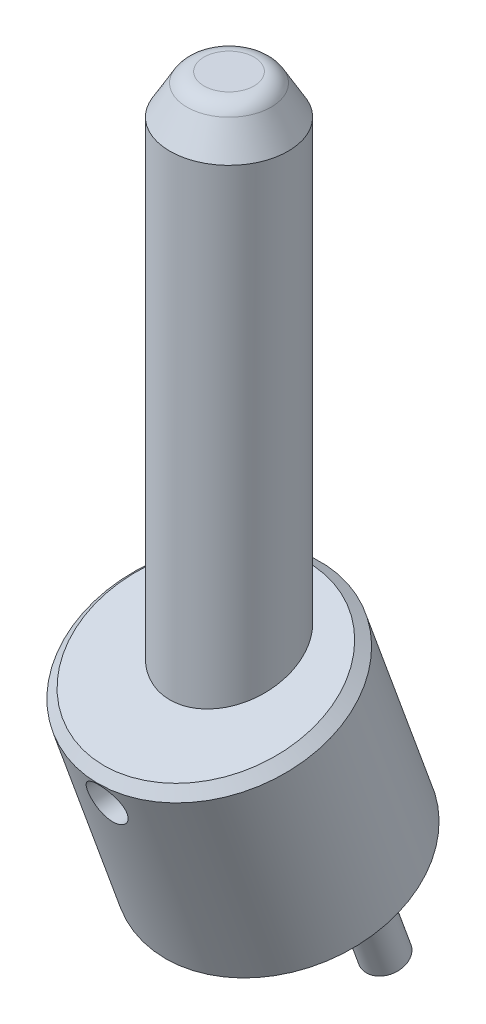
ISO-10303-21;
HEADER;
FILE_DESCRIPTION(('STEP AP214'),'2;1');
FILE_NAME('part.step','',(''),(''),'','','');
FILE_SCHEMA(('AUTOMOTIVE_DESIGN { 1 0 10303 214 1 1 1 1 }'));
ENDSEC;
DATA;
#1=APPLICATION_CONTEXT('core data for automotive mechanical design processes');
#2=APPLICATION_PROTOCOL_DEFINITION('international standard','automotive_design',2000,#1);
#3=PRODUCT_CONTEXT('',#1,'mechanical');
#4=PRODUCT('Part','Part','',(#3));
#5=PRODUCT_RELATED_PRODUCT_CATEGORY('part','',(#4));
#6=PRODUCT_DEFINITION_FORMATION('','',#4);
#7=PRODUCT_DEFINITION_CONTEXT('part definition',#1,'design');
#8=PRODUCT_DEFINITION('design','',#6,#7);
#9=PRODUCT_DEFINITION_SHAPE('','',#8);
#10=(LENGTH_UNIT() NAMED_UNIT(*) SI_UNIT(.MILLI.,.METRE.));
#11=(NAMED_UNIT(*) PLANE_ANGLE_UNIT() SI_UNIT($,.RADIAN.));
#12=(NAMED_UNIT(*) SI_UNIT($,.STERADIAN.) SOLID_ANGLE_UNIT());
#13=UNCERTAINTY_MEASURE_WITH_UNIT(LENGTH_MEASURE(1.E-05),#10,'distance_accuracy_value','');
#14=(GEOMETRIC_REPRESENTATION_CONTEXT(3) GLOBAL_UNCERTAINTY_ASSIGNED_CONTEXT((#13)) GLOBAL_UNIT_ASSIGNED_CONTEXT((#10,
#11,#12)) REPRESENTATION_CONTEXT('',''));
#15=CARTESIAN_POINT('',(0.,0.,0.));
#16=DIRECTION('',(0.,0.,1.));
#17=DIRECTION('',(1.,0.,0.));
#18=AXIS2_PLACEMENT_3D('',#15,#16,#17);
#19=CARTESIAN_POINT('',(0.,68.,0.));
#20=DIRECTION('',(0.,1.,0.));
#21=DIRECTION('',(-1.,0.,0.));
#22=AXIS2_PLACEMENT_3D('',#19,#20,#21);
#23=PLANE('',#22);
#24=CARTESIAN_POINT('',(0.,68.,-2.535898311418));
#25=CARTESIAN_POINT('',(0.036883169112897,68.,-2.53589886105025));
#26=CARTESIAN_POINT('',(0.073766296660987,68.,-2.53509366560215));
#27=CARTESIAN_POINT('',(0.147462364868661,68.,-2.53187573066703));
#28=CARTESIAN_POINT('',(0.184275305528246,68.,-2.52946299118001));
#29=CARTESIAN_POINT('',(0.257760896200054,68.,-2.52303391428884));
#30=CARTESIAN_POINT('',(0.294433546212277,68.,-2.51901757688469));
#31=CARTESIAN_POINT('',(0.367568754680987,68.,-2.50938912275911));
#32=CARTESIAN_POINT('',(0.404031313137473,68.,-2.50377700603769));
#33=CARTESIAN_POINT('',(0.476676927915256,68.,-2.49096762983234));
#34=CARTESIAN_POINT('',(0.512859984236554,68.,-2.48377037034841));
#35=CARTESIAN_POINT('',(0.584877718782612,68.,-2.46780442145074));
#36=CARTESIAN_POINT('',(0.620712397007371,68.,-2.459035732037));
#37=CARTESIAN_POINT('',(0.6919651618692,68.,-2.43994361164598));
#38=CARTESIAN_POINT('',(0.72738324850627,68.,-2.42962018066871));
#39=CARTESIAN_POINT('',(0.79773540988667,68.,-2.4074382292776));
#40=CARTESIAN_POINT('',(0.83266948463,68.,-2.39557970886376));
#41=CARTESIAN_POINT('',(0.901987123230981,68.,-2.37035015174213));
#42=CARTESIAN_POINT('',(0.936370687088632,68.,-2.35697911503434));
#43=CARTESIAN_POINT('',(1.00452185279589,68.,-2.32874997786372));
#44=CARTESIAN_POINT('',(1.0382894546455,68.,-2.31389187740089));
#45=CARTESIAN_POINT('',(1.10514441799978,68.,-2.28271689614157));
#46=CARTESIAN_POINT('',(1.13823177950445,68.,-2.26640001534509));
#47=CARTESIAN_POINT('',(1.20366327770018,68.,-2.23233853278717));
#48=CARTESIAN_POINT('',(1.23600741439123,68.,-2.21459393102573));
#49=CARTESIAN_POINT('',(1.29989089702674,68.,-2.17771078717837));
#50=CARTESIAN_POINT('',(1.3314302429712,68.,-2.15857224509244));
#51=CARTESIAN_POINT('',(1.3936440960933,68.,-2.11893764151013));
#52=CARTESIAN_POINT('',(1.42431860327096,67.9999999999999,-2.09844158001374));
#53=CARTESIAN_POINT('',(1.48474442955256,68.0000000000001,-2.05613099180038));
#54=CARTESIAN_POINT('',(1.51449574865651,68.0000000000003,-2.03431646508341));
#55=CARTESIAN_POINT('',(1.57301841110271,67.9999999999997,-1.98941032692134));
#56=CARTESIAN_POINT('',(1.60178975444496,67.9999999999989,-1.96631871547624));
#57=CARTESIAN_POINT('',(1.65829827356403,68.0000000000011,-1.91890290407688));
#58=CARTESIAN_POINT('',(1.68603544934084,68.0000000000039,-1.89457870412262));
#59=CARTESIAN_POINT('',(1.74042068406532,67.9999999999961,-1.8447420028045));
#60=CARTESIAN_POINT('',(1.76706874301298,67.9999999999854,-1.81922950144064));
#61=CARTESIAN_POINT('',(1.8202925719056,68.0000000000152,-1.76601289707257));
#62=CARTESIAN_POINT('',(1.84682143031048,68.0000000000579,-1.73826186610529));
#63=CARTESIAN_POINT('',(1.89860822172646,67.9999999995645,-1.68159729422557));
#64=CARTESIAN_POINT('',(1.9238661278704,67.9999999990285,-1.65268372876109));
#65=CARTESIAN_POINT('',(1.97305871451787,67.9999999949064,-1.59375026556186));
#66=CARTESIAN_POINT('',(1.99699333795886,67.9999999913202,-1.56373032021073));
#67=CARTESIAN_POINT('',(2.04349107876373,67.9999999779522,-1.50264174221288));
#68=CARTESIAN_POINT('',(2.06605410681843,67.9999999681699,-1.47157304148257));
#69=CARTESIAN_POINT('',(2.09883858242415,67.9999999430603,-1.42423763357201));
#70=CARTESIAN_POINT('',(2.10959070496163,67.9999999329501,-1.40833608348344));
#71=CARTESIAN_POINT('',(2.13071681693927,67.999999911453,-1.37630626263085));
#72=CARTESIAN_POINT('',(2.14109117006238,67.9999999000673,-1.36017823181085));
#73=CARTESIAN_POINT('',(2.17164317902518,67.9999998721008,-1.3114348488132));
#74=CARTESIAN_POINT('',(2.19125046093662,67.9999998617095,-1.27845923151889));
#75=CARTESIAN_POINT('',(2.22889472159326,67.9999998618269,-1.21162643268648));
#76=CARTESIAN_POINT('',(2.24693170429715,67.9999998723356,-1.17776925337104));
#77=CARTESIAN_POINT('',(2.28142653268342,67.9999999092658,-1.1092602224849));
#78=CARTESIAN_POINT('',(2.2978844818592,67.9999999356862,-1.07460842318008));
#79=CARTESIAN_POINT('',(2.32906360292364,67.9999999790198,-1.00453892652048));
#80=CARTESIAN_POINT('',(2.34378499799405,67.9999999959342,-0.969121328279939));
#81=CARTESIAN_POINT('',(2.36475646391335,68.0000000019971,-0.915929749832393));
#82=CARTESIAN_POINT('',(2.37150563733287,68.0000000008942,-0.89834771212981));
#83=CARTESIAN_POINT('',(2.3993801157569,67.9999999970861,-0.823272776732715));
#84=CARTESIAN_POINT('',(2.41865195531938,67.9999999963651,-0.765068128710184));
#85=CARTESIAN_POINT('',(2.44418154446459,67.9999999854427,-0.677429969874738));
#86=CARTESIAN_POINT('',(2.45206541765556,67.9999999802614,-0.648455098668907));
#87=CARTESIAN_POINT('',(2.46787714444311,67.9999999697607,-0.585935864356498));
#88=CARTESIAN_POINT('',(2.4756393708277,67.9999999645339,-0.552348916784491));
#89=CARTESIAN_POINT('',(2.48574292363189,67.999999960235,-0.504089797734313));
#90=CARTESIAN_POINT('',(2.4886547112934,67.999999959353,-0.489534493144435));
#91=CARTESIAN_POINT('',(2.49475257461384,67.9999999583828,-0.457572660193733));
#92=CARTESIAN_POINT('',(2.49788385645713,67.9999999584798,-0.440155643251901));
#93=CARTESIAN_POINT('',(2.50672485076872,67.9999999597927,-0.387811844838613));
#94=CARTESIAN_POINT('',(2.51188216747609,67.9999999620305,-0.352790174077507));
#95=CARTESIAN_POINT('',(2.52071043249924,67.9999999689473,-0.282561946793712));
#96=CARTESIAN_POINT('',(2.52438141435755,67.9999999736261,-0.247355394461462));
#97=CARTESIAN_POINT('',(2.53023391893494,67.9999999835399,-0.176819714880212));
#98=CARTESIAN_POINT('',(2.53241550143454,67.9999999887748,-0.141490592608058));
#99=CARTESIAN_POINT('',(2.53527542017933,67.9999999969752,-0.0707738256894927));
#100=CARTESIAN_POINT('',(2.53595384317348,67.9999999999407,-0.0353861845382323));
#101=CARTESIAN_POINT('',(2.53584272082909,68.0000000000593,0.0354236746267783));
#102=CARTESIAN_POINT('',(2.53505161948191,67.9999999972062,0.07084588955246));
#103=CARTESIAN_POINT('',(2.53203406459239,67.9999999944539,0.141627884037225));
#104=CARTESIAN_POINT('',(2.52980765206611,67.9999999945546,0.176987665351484));
#105=CARTESIAN_POINT('',(2.52391931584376,67.9999999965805,0.247588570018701));
#106=CARTESIAN_POINT('',(2.52025736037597,67.9999999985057,0.282829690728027));
#107=CARTESIAN_POINT('',(2.51148467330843,68.0000000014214,0.353133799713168));
#108=CARTESIAN_POINT('',(2.50637383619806,68.0000000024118,0.388196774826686));
#109=CARTESIAN_POINT('',(2.49768726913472,67.9999999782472,0.440622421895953));
#110=CARTESIAN_POINT('',(2.49462144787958,67.9999999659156,0.458070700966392));
#111=CARTESIAN_POINT('',(2.48998638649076,67.9999999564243,0.48262212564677));
#112=CARTESIAN_POINT('',(2.48860040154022,67.9999999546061,0.489759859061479));
#113=CARTESIAN_POINT('',(2.48087790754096,67.999999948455,0.528551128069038));
#114=CARTESIAN_POINT('',(2.47391141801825,67.9999999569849,0.560081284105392));
#115=CARTESIAN_POINT('',(2.45703812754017,67.9999999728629,0.630094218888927));
#116=CARTESIAN_POINT('',(2.44682379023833,67.9999999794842,0.66850231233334));
#117=CARTESIAN_POINT('',(2.42009300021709,67.9999999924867,0.760237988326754));
#118=CARTESIAN_POINT('',(2.40269884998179,67.9999999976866,0.813314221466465));
#119=CARTESIAN_POINT('',(2.37532992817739,67.9999999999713,0.888439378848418));
#120=CARTESIAN_POINT('',(2.36674512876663,67.9999999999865,0.911006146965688));
#121=CARTESIAN_POINT('',(2.34370620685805,68.0000000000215,0.969129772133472));
#122=CARTESIAN_POINT('',(2.32877605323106,68.000000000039,1.00450008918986));
#123=CARTESIAN_POINT('',(2.29733863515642,67.9999999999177,1.07453194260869));
#124=CARTESIAN_POINT('',(2.28083134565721,67.9999999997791,1.10919346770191));
#125=CARTESIAN_POINT('',(2.24628151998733,67.9999999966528,1.17774452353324));
#126=CARTESIAN_POINT('',(2.22823891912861,67.9999999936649,1.21163402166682));
#127=CARTESIAN_POINT('',(2.19064876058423,67.9999999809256,1.27857233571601));
#128=CARTESIAN_POINT('',(2.17110110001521,67.9999999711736,1.31162109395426));
#129=CARTESIAN_POINT('',(2.14068915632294,67.9999999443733,1.3605143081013));
#130=CARTESIAN_POINT('',(2.13036939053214,67.9999999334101,1.37669975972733));
#131=CARTESIAN_POINT('',(2.10937145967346,67.9999999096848,1.40881381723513));
#132=CARTESIAN_POINT('',(2.09869365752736,67.9999998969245,1.4247426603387));
#133=CARTESIAN_POINT('',(2.06610221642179,67.9999998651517,1.47214715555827));
#134=CARTESIAN_POINT('',(2.04363000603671,67.999999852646,1.50324163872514));
#135=CARTESIAN_POINT('',(1.99724969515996,67.9999998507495,1.56433742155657));
#136=CARTESIAN_POINT('',(1.97334159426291,67.9999998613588,1.59433872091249));
#137=CARTESIAN_POINT('',(1.92416677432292,67.9999999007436,1.65320597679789));
#138=CARTESIAN_POINT('',(1.89890014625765,67.999999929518,1.68207200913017));
#139=CARTESIAN_POINT('',(1.84696904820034,67.999999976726,1.73850866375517));
#140=CARTESIAN_POINT('',(1.82030476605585,67.999999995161,1.76607945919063));
#141=CARTESIAN_POINT('',(1.77844405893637,68.0000000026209,1.80781307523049));
#142=CARTESIAN_POINT('',(1.76359360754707,68.0000000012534,1.82232877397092));
#143=CARTESIAN_POINT('',(1.70076532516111,67.9999999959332,1.8822704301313));
#144=CARTESIAN_POINT('',(1.65118457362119,67.9999999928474,1.92605591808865));
#145=CARTESIAN_POINT('',(1.5748830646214,67.9999999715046,1.9882957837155));
#146=CARTESIAN_POINT('',(1.54939187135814,67.9999999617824,2.00828585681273));
#147=CARTESIAN_POINT('',(1.49369879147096,67.9999999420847,2.050241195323));
#148=CARTESIAN_POINT('',(1.46337192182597,67.9999999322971,2.07204201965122));
#149=CARTESIAN_POINT('',(1.41924057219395,67.9999999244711,2.10228130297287));
#150=CARTESIAN_POINT('',(1.40582016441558,67.9999999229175,2.11128590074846));
#151=CARTESIAN_POINT('',(1.37628726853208,67.9999999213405,2.13068692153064));
#152=CARTESIAN_POINT('',(1.36013950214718,67.9999999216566,2.14102971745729));
#153=CARTESIAN_POINT('',(1.31134786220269,67.9999999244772,2.17149865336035));
#154=CARTESIAN_POINT('',(1.27835328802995,67.9999999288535,2.19106696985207));
#155=CARTESIAN_POINT('',(1.21150292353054,67.9999999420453,2.22866698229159));
#156=CARTESIAN_POINT('',(1.17764716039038,67.9999999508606,2.2466987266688));
#157=CARTESIAN_POINT('',(1.10914688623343,67.9999999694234,2.28119223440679));
#158=CARTESIAN_POINT('',(1.07450241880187,67.9999999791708,2.29765408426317));
#159=CARTESIAN_POINT('',(1.00449363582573,67.9999999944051,2.32896042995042));
#160=CARTESIAN_POINT('',(0.969129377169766,67.9999999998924,2.34380505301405));
#161=CARTESIAN_POINT('',(0.900489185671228,68.0000000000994,2.37082264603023));
#162=CARTESIAN_POINT('',(0.867259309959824,67.9999999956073,2.383112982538));
#163=CARTESIAN_POINT('',(0.800333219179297,67.9999999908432,2.40634607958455));
#164=CARTESIAN_POINT('',(0.766637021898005,67.9999999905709,2.4172888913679));
#165=CARTESIAN_POINT('',(0.698829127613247,67.9999999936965,2.43780461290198));
#166=CARTESIAN_POINT('',(0.664717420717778,67.9999999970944,2.44737748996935));
#167=CARTESIAN_POINT('',(0.596126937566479,68.0000000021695,2.46511837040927));
#168=CARTESIAN_POINT('',(0.561648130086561,68.0000000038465,2.47328625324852));
#169=CARTESIAN_POINT('',(0.515953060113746,67.9999999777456,2.48318601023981));
#170=CARTESIAN_POINT('',(0.504864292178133,67.999999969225,2.48551694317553));
#171=CARTESIAN_POINT('',(0.482616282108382,67.9999999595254,2.48998940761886));
#172=CARTESIAN_POINT('',(0.471456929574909,67.9999999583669,2.492130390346));
#173=CARTESIAN_POINT('',(0.423172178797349,67.9999999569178,2.50104304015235));
#174=CARTESIAN_POINT('',(0.385898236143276,67.999999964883,2.50702839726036));
#175=CARTESIAN_POINT('',(0.321772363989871,67.9999999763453,2.51585849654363));
#176=CARTESIAN_POINT('',(0.294975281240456,67.9999999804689,2.5191122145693));
#177=CARTESIAN_POINT('',(0.23919081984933,67.9999999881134,2.52498124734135));
#178=CARTESIAN_POINT('',(0.210196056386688,67.9999999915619,2.52752672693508));
#179=CARTESIAN_POINT('',(0.144283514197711,67.9999999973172,2.53217247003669));
#180=CARTESIAN_POINT('',(0.107343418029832,67.9999999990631,2.5339662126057));
#181=CARTESIAN_POINT('',(0.0598216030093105,67.9999999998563,2.535240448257));
#182=CARTESIAN_POINT('',(0.0492560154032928,67.9999999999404,2.53545812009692));
#183=CARTESIAN_POINT('',(0.0257940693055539,68.0000000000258,2.5358007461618));
#184=CARTESIAN_POINT('',(0.0128972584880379,68.0000000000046,2.53589469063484));
#185=CARTESIAN_POINT('',(0.,68.,2.535898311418));
#186=B_SPLINE_CURVE_WITH_KNOTS('',3,(#24,#25,#26,#27,#28,#29,#30,#31,#32,#33,#34,#35,#36,#37,
#38,#39,#40,#41,#42,#43,#44,#45,#46,#47,#48,#49,#50,#51,#52,#53,#54,#55,#56,#57,#58,#59,#60,#61,
#62,#63,#64,#65,#66,#67,#68,#69,#70,#71,#72,#73,#74,#75,#76,#77,#78,#79,#80,#81,#82,#83,#84,#85,
#86,#87,#88,#89,#90,#91,#92,#93,#94,#95,#96,#97,#98,#99,#100,#101,#102,#103,#104,#105,#106,#107,
#108,#109,#110,#111,#112,#113,#114,#115,#116,#117,#118,#119,#120,#121,#122,#123,#124,#125,#126,
#127,#128,#129,#130,#131,#132,#133,#134,#135,#136,#137,#138,#139,#140,#141,#142,#143,#144,#145,
#146,#147,#148,#149,#150,#151,#152,#153,#154,#155,#156,#157,#158,#159,#160,#161,#162,#163,#164,
#165,#166,#167,#168,#169,#170,#171,#172,#173,#174,#175,#176,#177,#178,#179,#180,#181,#182,#183,
#184,#185),.UNSPECIFIED.,.F.,.F.,(4,2,2,2,2,2,2,2,2,2,2,2,2,2,2,2,2,2,2,2,2,2,2,2,2,2,2,2,2,2,2,
2,2,2,2,2,2,2,2,2,2,2,2,2,2,2,2,2,2,2,2,2,2,2,2,2,2,2,2,2,2,2,2,2,2,2,2,2,2,2,2,2,2,2,2,2,2,2,2,
2,4),(0.,0.110640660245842,0.221281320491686,0.331921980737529,0.442562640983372,
0.553203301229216,0.663843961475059,0.774484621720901,0.885125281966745,0.995765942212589,
1.10640660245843,1.21704726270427,1.32768792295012,1.43832858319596,1.5489692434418,
1.65960990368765,1.77025056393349,1.88089122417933,1.99153188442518,2.1066670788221,
2.22180470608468,2.33694729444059,2.4520973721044,2.50967964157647,2.56720492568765,
2.68225193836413,2.79729866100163,2.91233783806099,3.02736221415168,3.08386094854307,
3.26759502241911,3.35766742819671,3.46104881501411,3.50557819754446,3.5586633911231,
3.664827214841,3.77098864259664,3.87714580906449,3.98329684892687,4.08956035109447,
4.19582081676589,4.30208363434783,4.40835419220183,4.46149681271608,4.48330971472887,
4.58015248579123,4.69934379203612,4.86676229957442,4.93919017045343,5.05432498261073,
5.16946162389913,5.28460311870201,5.39975249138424,5.45733469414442,5.51486019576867,
5.62990814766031,5.7449561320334,5.8599964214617,5.97502128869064,6.03732000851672,
6.23550767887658,6.33267539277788,6.44467917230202,6.49316106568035,6.55068488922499,
6.66572394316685,6.78075936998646,6.89578845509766,7.01080848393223,7.11706931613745,
7.22332610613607,7.32958543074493,7.43585386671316,7.46984616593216,7.50393367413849,
7.61714192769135,7.69811153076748,7.78541399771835,7.89632395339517,7.92802697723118,
7.96671753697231),.UNSPECIFIED.);
#187=CARTESIAN_POINT('',(0.,68.,-2.5358983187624));
#188=VERTEX_POINT('',#187);
#189=CARTESIAN_POINT('',(0.,68.,2.5358983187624));
#190=VERTEX_POINT('',#189);
#191=EDGE_CURVE('P0_E38',#188,#190,#186,.T.);
#192=ORIENTED_EDGE('',*,*,#191,.F.);
#193=CARTESIAN_POINT('',(0.,68.,0.));
#194=DIRECTION('',(0.,-1.,0.));
#195=DIRECTION('',(0.,0.,1.));
#196=AXIS2_PLACEMENT_3D('',#193,#194,#195);
#197=CIRCLE('',#196,2.535898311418);
#198=EDGE_CURVE('P0_E42',#190,#188,#197,.T.);
#199=ORIENTED_EDGE('',*,*,#198,.F.);
#200=EDGE_LOOP('',(#192,#199));
#201=FACE_BOUND('',#200,.T.);
#202=ADVANCED_FACE('P0_F17',(#201),#23,.T.);
#203=CARTESIAN_POINT('',(0.,66.,0.));
#204=DIRECTION('',(0.,1.,0.));
#205=DIRECTION('',(0.0152566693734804,0.,0.999883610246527));
#206=AXIS2_PLACEMENT_3D('',#203,#204,#205);
#207=TOROIDAL_SURFACE('',#206,2.535898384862,2.);
#208=ORIENTED_EDGE('',*,*,#191,.T.);
#209=ORIENTED_EDGE('',*,*,#198,.T.);
#210=EDGE_LOOP('',(#208,#209));
#211=FACE_BOUND('',#210,.T.);
#212=CARTESIAN_POINT('',(0.,67.000000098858,0.));
#213=DIRECTION('',(0.,-1.,0.));
#214=DIRECTION('',(0.,0.,1.));
#215=AXIS2_PLACEMENT_3D('',#212,#213,#214);
#216=CIRCLE('',#215,4.26794913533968);
#217=CARTESIAN_POINT('',(0.,67.000000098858,4.26794913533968));
#218=VERTEX_POINT('',#217);
#219=EDGE_CURVE('P0_E48',#218,#218,#216,.T.);
#220=ORIENTED_EDGE('',*,*,#219,.F.);
#221=EDGE_LOOP('',(#220));
#222=FACE_BOUND('',#221,.T.);
#223=ADVANCED_FACE('P0_F40',(#211,#222),#207,.T.);
#224=CARTESIAN_POINT('',(0.,0.,0.));
#225=DIRECTION('',(0.,1.,0.));
#226=DIRECTION('',(-1.,0.,0.));
#227=AXIS2_PLACEMENT_3D('',#224,#225,#226);
#228=PLANE('',#227);
#229=CARTESIAN_POINT('',(0.,0.,0.));
#230=DIRECTION('',(0.,1.,0.));
#231=DIRECTION('',(-1.,0.,0.));
#232=AXIS2_PLACEMENT_3D('',#229,#230,#231);
#233=CIRCLE('',#232,5.00000122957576);
#234=CARTESIAN_POINT('',(-5.00000122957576,0.,0.));
#235=VERTEX_POINT('',#234);
#236=EDGE_CURVE('P0_E85',#235,#235,#233,.T.);
#237=ORIENTED_EDGE('',*,*,#236,.F.);
#238=EDGE_LOOP('',(#237));
#239=FACE_BOUND('',#238,.T.);
#240=ADVANCED_FACE('P0_F76',(#239),#228,.F.);
#241=CARTESIAN_POINT('',(0.,10.,2.15470053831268));
#242=DIRECTION('',(0.,0.,1.));
#243=DIRECTION('',(0.,-1.,0.));
#244=AXIS2_PLACEMENT_3D('',#241,#242,#243);
#245=CONICAL_SURFACE('',#244,2.00000000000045,1.0471975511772);
#246=CARTESIAN_POINT('',(0.,9.99999999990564,0.99999999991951));
#247=VERTEX_POINT('',#246);
#248=VERTEX_LOOP('',#247);
#249=FACE_BOUND('',#248,.T.);
#250=CARTESIAN_POINT('',(0.,10.,2.154700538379));
#251=DIRECTION('',(0.,0.,1.));
#252=DIRECTION('',(0.,-1.,0.));
#253=AXIS2_PLACEMENT_3D('',#250,#251,#252);
#254=CIRCLE('',#253,2.);
#255=CARTESIAN_POINT('',(0.,8.,2.154700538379));
#256=VERTEX_POINT('',#255);
#257=EDGE_CURVE('P0_E82',#256,#256,#254,.T.);
#258=ORIENTED_EDGE('',*,*,#257,.T.);
#259=EDGE_LOOP('',(#258));
#260=FACE_BOUND('',#259,.T.);
#261=ADVANCED_FACE('P0_F116',(#249,#260),#245,.F.);
#262=CARTESIAN_POINT('',(0.,63.9999999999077,0.));
#263=DIRECTION('',(0.,-1.,0.));
#264=DIRECTION('',(1.,0.,0.));
#265=AXIS2_PLACEMENT_3D('',#262,#263,#264);
#266=CONICAL_SURFACE('',#265,6.00000000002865,0.523598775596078);
#267=CARTESIAN_POINT('',(0.,64.,0.));
#268=DIRECTION('',(0.,1.,0.));
#269=DIRECTION('',(-1.,0.,0.));
#270=AXIS2_PLACEMENT_3D('',#267,#268,#269);
#271=CIRCLE('',#270,6.);
#272=CARTESIAN_POINT('',(-6.,64.,0.));
#273=VERTEX_POINT('',#272);
#274=EDGE_CURVE('P0_E92',#273,#273,#271,.F.);
#275=ORIENTED_EDGE('',*,*,#274,.F.);
#276=EDGE_LOOP('',(#275));
#277=FACE_BOUND('',#276,.T.);
#278=ORIENTED_EDGE('',*,*,#219,.T.);
#279=EDGE_LOOP('',(#278));
#280=FACE_BOUND('',#279,.T.);
#281=ADVANCED_FACE('P0_F108',(#277,#280),#266,.T.);
#282=CARTESIAN_POINT('',(0.,1.00000004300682,0.));
#283=DIRECTION('',(0.,1.,0.));
#284=DIRECTION('',(-1.,0.,0.));
#285=AXIS2_PLACEMENT_3D('',#282,#283,#284);
#286=CONICAL_SURFACE('',#285,6.0000015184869,0.785398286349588);
#287=CARTESIAN_POINT('',(0.,1.000001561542,0.));
#288=DIRECTION('',(0.,1.,0.));
#289=DIRECTION('',(-1.,0.,0.));
#290=AXIS2_PLACEMENT_3D('',#287,#288,#289);
#291=CIRCLE('',#290,6.);
#292=CARTESIAN_POINT('',(-6.,1.000001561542,0.));
#293=VERTEX_POINT('',#292);
#294=EDGE_CURVE('P0_E28',#293,#293,#291,.T.);
#295=ORIENTED_EDGE('',*,*,#294,.F.);
#296=EDGE_LOOP('',(#295));
#297=FACE_BOUND('',#296,.T.);
#298=ORIENTED_EDGE('',*,*,#236,.T.);
#299=EDGE_LOOP('',(#298));
#300=FACE_BOUND('',#299,.T.);
#301=ADVANCED_FACE('P0_F105',(#297,#300),#286,.T.);
#302=CARTESIAN_POINT('',(0.,10.,0.65));
#303=DIRECTION('',(0.,0.,1.));
#304=DIRECTION('',(0.,-1.,0.));
#305=AXIS2_PLACEMENT_3D('',#302,#303,#304);
#306=CYLINDRICAL_SURFACE('',#305,2.);
#307=ORIENTED_EDGE('',*,*,#257,.F.);
#308=EDGE_LOOP('',(#307));
#309=FACE_BOUND('',#308,.T.);
#310=CARTESIAN_POINT('',(0.,8.,6.));
#311=CARTESIAN_POINT('',(-0.108974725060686,8.00000612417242,5.99999564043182));
#312=CARTESIAN_POINT('',(-0.218061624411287,8.00894817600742,5.9969989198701));
#313=CARTESIAN_POINT('',(-0.433135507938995,8.04441497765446,5.98531898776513));
#314=CARTESIAN_POINT('',(-0.539117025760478,8.07096899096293,5.97662631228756));
#315=CARTESIAN_POINT('',(-0.744677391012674,8.14064454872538,5.9545040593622));
#316=CARTESIAN_POINT('',(-0.844270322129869,8.18372807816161,5.94108535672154));
#317=CARTESIAN_POINT('',(-1.03478027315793,8.2851008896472,5.91088362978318));
#318=CARTESIAN_POINT('',(-1.12569835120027,8.34338831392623,5.8941010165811));
#319=CARTESIAN_POINT('',(-1.29948066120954,8.475649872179,5.8582823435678));
#320=CARTESIAN_POINT('',(-1.3820029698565,8.55005856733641,5.83919212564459));
#321=CARTESIAN_POINT('',(-1.53366185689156,8.71152973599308,5.80120729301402));
#322=CARTESIAN_POINT('',(-1.60279478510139,8.79859564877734,5.78231273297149));
#323=CARTESIAN_POINT('',(-1.72765000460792,8.98597045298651,5.7462666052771));
#324=CARTESIAN_POINT('',(-1.78292996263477,9.08658794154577,5.72918070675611));
#325=CARTESIAN_POINT('',(-1.87563792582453,9.2963526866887,5.69950605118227));
#326=CARTESIAN_POINT('',(-1.91307145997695,9.40549728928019,5.68691590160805));
#327=CARTESIAN_POINT('',(-1.96774691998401,9.62534643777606,5.66822606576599));
#328=CARTESIAN_POINT('',(-1.98562689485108,9.73587440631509,5.66192191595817));
#329=CARTESIAN_POINT('',(-2.00268224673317,9.95852749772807,5.65591313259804));
#330=CARTESIAN_POINT('',(-2.00186340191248,10.0706521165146,5.65620646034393));
#331=CARTESIAN_POINT('',(-1.98203983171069,10.2878730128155,5.66318029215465));
#332=CARTESIAN_POINT('',(-1.96386791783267,10.393056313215,5.66956828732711));
#333=CARTESIAN_POINT('',(-1.9112124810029,10.5987863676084,5.68753310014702));
#334=CARTESIAN_POINT('',(-1.87672692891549,10.699332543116,5.69911056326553));
#335=CARTESIAN_POINT('',(-1.79187699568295,10.8948281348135,5.72635859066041));
#336=CARTESIAN_POINT('',(-1.74126547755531,10.9896611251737,5.74209216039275));
#337=CARTESIAN_POINT('',(-1.62577463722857,11.1697464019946,5.77585213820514));
#338=CARTESIAN_POINT('',(-1.56089195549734,11.2549964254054,5.79387908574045));
#339=CARTESIAN_POINT('',(-1.41471183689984,11.4181688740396,5.83134330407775));
#340=CARTESIAN_POINT('',(-1.33273573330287,11.4954788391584,5.85080514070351));
#341=CARTESIAN_POINT('',(-1.15670996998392,11.6354411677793,5.88813263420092));
#342=CARTESIAN_POINT('',(-1.06265504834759,11.6980871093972,5.90599758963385));
#343=CARTESIAN_POINT('',(-0.86381483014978,11.8074392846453,5.93835612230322));
#344=CARTESIAN_POINT('',(-0.75892625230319,11.8539693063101,5.95281190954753));
#345=CARTESIAN_POINT('',(-0.542326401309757,11.9284560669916,5.97642703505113));
#346=CARTESIAN_POINT('',(-0.430629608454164,11.9564508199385,5.98559720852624));
#347=CARTESIAN_POINT('',(-0.264915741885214,11.9830911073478,5.99438078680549));
#348=CARTESIAN_POINT('',(-0.212162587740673,11.9894240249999,5.99648164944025));
#349=CARTESIAN_POINT('',(-0.106281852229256,11.9978799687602,5.99929232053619));
#350=CARTESIAN_POINT('',(-0.0531542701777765,12.000002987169,6.00000212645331));
#351=CARTESIAN_POINT('',(0.108974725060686,11.9999938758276,5.99999564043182));
#352=CARTESIAN_POINT('',(0.218061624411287,11.9910518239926,5.9969989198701));
#353=CARTESIAN_POINT('',(0.433135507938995,11.9555850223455,5.98531898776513));
#354=CARTESIAN_POINT('',(0.539117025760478,11.9290310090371,5.97662631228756));
#355=CARTESIAN_POINT('',(0.744677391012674,11.8593554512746,5.9545040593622));
#356=CARTESIAN_POINT('',(0.844270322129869,11.8162719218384,5.94108535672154));
#357=CARTESIAN_POINT('',(1.03478027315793,11.7148991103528,5.91088362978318));
#358=CARTESIAN_POINT('',(1.12569835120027,11.6566116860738,5.8941010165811));
#359=CARTESIAN_POINT('',(1.29948066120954,11.524350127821,5.8582823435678));
#360=CARTESIAN_POINT('',(1.3820029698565,11.4499414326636,5.83919212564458));
#361=CARTESIAN_POINT('',(1.53366185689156,11.2884702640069,5.80120729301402));
#362=CARTESIAN_POINT('',(1.60279478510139,11.2014043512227,5.78231273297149));
#363=CARTESIAN_POINT('',(1.72765000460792,11.0140295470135,5.7462666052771));
#364=CARTESIAN_POINT('',(1.78292996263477,10.9134120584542,5.72918070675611));
#365=CARTESIAN_POINT('',(1.87563792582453,10.7036473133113,5.69950605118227));
#366=CARTESIAN_POINT('',(1.91307145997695,10.5945027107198,5.68691590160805));
#367=CARTESIAN_POINT('',(1.96774691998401,10.3746535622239,5.66822606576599));
#368=CARTESIAN_POINT('',(1.98562689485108,10.2641255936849,5.66192191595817));
#369=CARTESIAN_POINT('',(2.00268224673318,10.0414725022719,5.65591313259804));
#370=CARTESIAN_POINT('',(2.00186340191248,9.92934788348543,5.65620646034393));
#371=CARTESIAN_POINT('',(1.98203983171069,9.71212698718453,5.66318029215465));
#372=CARTESIAN_POINT('',(1.96386791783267,9.60694368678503,5.66956828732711));
#373=CARTESIAN_POINT('',(1.9112124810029,9.40121363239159,5.68753310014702));
#374=CARTESIAN_POINT('',(1.87672692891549,9.30066745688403,5.69911056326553));
#375=CARTESIAN_POINT('',(1.79187699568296,9.10517186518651,5.72635859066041));
#376=CARTESIAN_POINT('',(1.74126547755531,9.01033887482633,5.74209216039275));
#377=CARTESIAN_POINT('',(1.62577463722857,8.83025359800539,5.77585213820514));
#378=CARTESIAN_POINT('',(1.56089195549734,8.74500357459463,5.79387908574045));
#379=CARTESIAN_POINT('',(1.41471183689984,8.58183112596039,5.83134330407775));
#380=CARTESIAN_POINT('',(1.33273573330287,8.50452116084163,5.85080514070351));
#381=CARTESIAN_POINT('',(1.15670996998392,8.36455883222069,5.88813263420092));
#382=CARTESIAN_POINT('',(1.06265504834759,8.30191289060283,5.90599758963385));
#383=CARTESIAN_POINT('',(0.86381483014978,8.19256071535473,5.93835612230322));
#384=CARTESIAN_POINT('',(0.75892625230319,8.14603069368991,5.95281190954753));
#385=CARTESIAN_POINT('',(0.542326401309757,8.07154393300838,5.97642703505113));
#386=CARTESIAN_POINT('',(0.430629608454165,8.04354918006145,5.98559720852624));
#387=CARTESIAN_POINT('',(0.264915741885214,8.01690889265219,5.99438078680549));
#388=CARTESIAN_POINT('',(0.212162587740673,8.01057597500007,5.99648164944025));
#389=CARTESIAN_POINT('',(0.106281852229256,8.00212003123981,5.99929232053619));
#390=CARTESIAN_POINT('',(0.0531542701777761,7.99999701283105,6.00000212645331));
#391=CARTESIAN_POINT('',(0.,8.,6.));
#392=B_SPLINE_CURVE_WITH_KNOTS('',3,(#310,#311,#312,#313,#314,#315,#316,#317,#318,#319,#320,
#321,#322,#323,#324,#325,#326,#327,#328,#329,#330,#331,#332,#333,#334,#335,#336,#337,#338,#339,
#340,#341,#342,#343,#344,#345,#346,#347,#348,#349,#350,#351,#352,#353,#354,#355,#356,#357,#358,
#359,#360,#361,#362,#363,#364,#365,#366,#367,#368,#369,#370,#371,#372,#373,#374,#375,#376,#377,
#378,#379,#380,#381,#382,#383,#384,#385,#386,#387,#388,#389,#390,#391),.UNSPECIFIED.,.T.,.F.,(4,
2,2,2,2,2,2,2,2,2,2,2,2,2,2,2,2,2,2,2,2,2,2,2,2,2,2,2,2,2,2,2,2,2,2,2,2,2,2,2,4),(0.,
0.32671907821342,0.653982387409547,0.980497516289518,1.30697276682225,1.64368488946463,
1.98048867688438,2.32696849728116,2.67334090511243,3.00803851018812,3.34263269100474,
3.6619357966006,3.98127862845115,4.30577211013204,4.63034206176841,4.97180786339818,
5.31342292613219,5.65866330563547,6.00319342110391,6.16255590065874,6.32191867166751,
6.64863774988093,6.97590105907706,7.30241618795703,7.62889143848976,7.96560356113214,
8.30240734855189,8.64888716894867,8.99525957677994,9.32995718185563,9.66455136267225,
9.98385446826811,10.3031973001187,10.6276907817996,10.9522607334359,11.2937265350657,
11.6353415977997,11.980581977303,12.3251120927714,12.4844745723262,12.643837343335),.UNSPECIFIED.);
#393=CARTESIAN_POINT('',(0.,8.,6.));
#394=VERTEX_POINT('',#393);
#395=EDGE_CURVE('P0_E11',#394,#394,#392,.T.);
#396=ORIENTED_EDGE('',*,*,#395,.F.);
#397=EDGE_LOOP('',(#396));
#398=FACE_BOUND('',#397,.T.);
#399=ADVANCED_FACE('P0_F107',(#309,#398),#306,.F.);
#400=CARTESIAN_POINT('',(0.,-3.4,0.));
#401=DIRECTION('',(0.,1.,0.));
#402=DIRECTION('',(-1.,0.,0.));
#403=AXIS2_PLACEMENT_3D('',#400,#401,#402);
#404=CYLINDRICAL_SURFACE('',#403,6.);
#405=ORIENTED_EDGE('',*,*,#274,.T.);
#406=EDGE_LOOP('',(#405));
#407=FACE_BOUND('',#406,.T.);
#408=ORIENTED_EDGE('',*,*,#294,.T.);
#409=EDGE_LOOP('',(#408));
#410=FACE_BOUND('',#409,.T.);
#411=ORIENTED_EDGE('',*,*,#395,.T.);
#412=EDGE_LOOP('',(#411));
#413=FACE_BOUND('',#412,.T.);
#414=ADVANCED_FACE('P0_F102',(#407,#410,#413),#404,.T.);
#415=CLOSED_SHELL('',(#202,#223,#240,#261,#281,#301,#399,#414));
#416=MANIFOLD_SOLID_BREP('P0_B1',#415);
#417=CARTESIAN_POINT('',(0.,-9.16644374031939,-7.22733246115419));
#418=DIRECTION('',(0.,-0.939692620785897,-0.342020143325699));
#419=DIRECTION('',(0.,0.342020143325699,-0.939692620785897));
#420=AXIS2_PLACEMENT_3D('',#417,#418,#419);
#421=PLANE('',#420);
#422=CARTESIAN_POINT('',(-8.75,-9.16644374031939,-7.22733246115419));
#423=DIRECTION('',(0.,-0.939692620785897,-0.342020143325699));
#424=DIRECTION('',(0.,0.342020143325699,-0.939692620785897));
#425=AXIS2_PLACEMENT_3D('',#422,#423,#424);
#426=CIRCLE('',#425,1.49996275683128);
#427=CARTESIAN_POINT('',(-8.75,-8.65342626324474,-8.63683639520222));
#428=VERTEX_POINT('',#427);
#429=EDGE_CURVE('P1_E17',#428,#428,#426,.F.);
#430=ORIENTED_EDGE('',*,*,#429,.F.);
#431=EDGE_LOOP('',(#430));
#432=FACE_BOUND('',#431,.T.);
#433=ADVANCED_FACE('P1_F14',(#432),#421,.T.);
#434=CARTESIAN_POINT('',(0.,-9.16644374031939,-7.22733246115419));
#435=DIRECTION('',(0.,-0.939692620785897,-0.342020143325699));
#436=DIRECTION('',(0.,0.342020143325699,-0.939692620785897));
#437=AXIS2_PLACEMENT_3D('',#434,#435,#436);
#438=PLANE('',#437);
#439=CARTESIAN_POINT('',(8.75,-9.16644374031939,-7.22733246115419));
#440=DIRECTION('',(0.,-0.939692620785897,-0.342020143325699));
#441=DIRECTION('',(0.,0.342020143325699,-0.939692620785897));
#442=AXIS2_PLACEMENT_3D('',#439,#440,#441);
#443=CIRCLE('',#442,1.49996275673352);
#444=CARTESIAN_POINT('',(8.75,-8.65342626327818,-8.63683639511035));
#445=VERTEX_POINT('',#444);
#446=EDGE_CURVE('P1_E114',#445,#445,#443,.F.);
#447=ORIENTED_EDGE('',*,*,#446,.F.);
#448=EDGE_LOOP('',(#447));
#449=FACE_BOUND('',#448,.T.);
#450=ADVANCED_FACE('P1_F104',(#449),#438,.T.);
#451=CARTESIAN_POINT('',(0.,3.31765864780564E-13,1.40512601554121E-13));
#452=DIRECTION('',(0.,-1.,0.));
#453=DIRECTION('',(0.,0.,-1.));
#454=AXIS2_PLACEMENT_3D('',#451,#452,#453);
#455=PLANE('',#454);
#456=CARTESIAN_POINT('',(0.,3.71664504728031E-13,-1.17614251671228E-12));
#457=DIRECTION('',(0.,-1.,0.));
#458=DIRECTION('',(0.,0.,-1.));
#459=AXIS2_PLACEMENT_3D('',#456,#457,#458);
#460=CIRCLE('',#459,6.);
#461=CARTESIAN_POINT('',(0.,3.71664504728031E-13,-6.00000000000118));
#462=VERTEX_POINT('',#461);
#463=EDGE_CURVE('P1_E116',#462,#462,#460,.F.);
#464=ORIENTED_EDGE('',*,*,#463,.T.);
#465=EDGE_LOOP('',(#464));
#466=FACE_BOUND('',#465,.T.);
#467=ADVANCED_FACE('P1_F101',(#466),#455,.F.);
#468=CARTESIAN_POINT('',(-8.75,-8.69657085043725,-7.05631271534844));
#469=DIRECTION('',(0.,0.939692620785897,0.342020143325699));
#470=DIRECTION('',(0.,-0.342020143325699,0.939692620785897));
#471=AXIS2_PLACEMENT_3D('',#468,#469,#470);
#472=CONICAL_SURFACE('',#471,1.99997862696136,0.785385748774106);
#473=CARTESIAN_POINT('',(-8.75,-8.69655076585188,-7.0563054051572));
#474=DIRECTION('',(0.,0.939692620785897,0.342020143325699));
#475=DIRECTION('',(0.,-0.342020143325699,0.939692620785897));
#476=AXIS2_PLACEMENT_3D('',#473,#474,#475);
#477=CIRCLE('',#476,2.);
#478=CARTESIAN_POINT('',(-8.75,-9.38059105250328,-5.1769201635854));
#479=VERTEX_POINT('',#478);
#480=EDGE_CURVE('P1_E118',#479,#479,#477,.T.);
#481=ORIENTED_EDGE('',*,*,#480,.F.);
#482=EDGE_LOOP('',(#481));
#483=FACE_BOUND('',#482,.T.);
#484=ORIENTED_EDGE('',*,*,#429,.T.);
#485=EDGE_LOOP('',(#484));
#486=FACE_BOUND('',#485,.T.);
#487=ADVANCED_FACE('P1_F97',(#483,#486),#472,.T.);
#488=CARTESIAN_POINT('',(8.75,-8.696570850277,-7.05631271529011));
#489=DIRECTION('',(0.,0.939692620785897,0.342020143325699));
#490=DIRECTION('',(0.,-0.342020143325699,0.939692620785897));
#491=AXIS2_PLACEMENT_3D('',#488,#489,#490);
#492=CONICAL_SURFACE('',#491,1.99997862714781,0.785385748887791);
#493=CARTESIAN_POINT('',(8.75,-8.69655076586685,-7.05630540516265));
#494=DIRECTION('',(0.,0.939692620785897,0.342020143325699));
#495=DIRECTION('',(0.,-0.342020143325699,0.939692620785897));
#496=AXIS2_PLACEMENT_3D('',#493,#494,#495);
#497=CIRCLE('',#496,2.);
#498=CARTESIAN_POINT('',(8.75,-9.38059105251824,-5.17692016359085));
#499=VERTEX_POINT('',#498);
#500=EDGE_CURVE('P1_E123',#499,#499,#497,.T.);
#501=ORIENTED_EDGE('',*,*,#500,.F.);
#502=EDGE_LOOP('',(#501));
#503=FACE_BOUND('',#502,.T.);
#504=ORIENTED_EDGE('',*,*,#446,.T.);
#505=EDGE_LOOP('',(#504));
#506=FACE_BOUND('',#505,.T.);
#507=ADVANCED_FACE('P1_F92',(#503,#506),#492,.T.);
#508=CARTESIAN_POINT('',(0.,26.271199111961,-1.17787724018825E-12));
#509=DIRECTION('',(0.,-1.,0.));
#510=DIRECTION('',(0.,0.,-1.));
#511=AXIS2_PLACEMENT_3D('',#508,#509,#510);
#512=CYLINDRICAL_SURFACE('',#511,6.);
#513=CARTESIAN_POINT('',(0.,18.0000000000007,-1.17787724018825E-12));
#514=DIRECTION('',(0.,0.939692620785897,0.342020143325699));
#515=DIRECTION('',(0.,-0.342020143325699,0.939692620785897));
#516=AXIS2_PLACEMENT_3D('',#513,#514,#515);
#517=ELLIPSE('',#516,6.38506663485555,6.);
#518=CARTESIAN_POINT('',(0.,15.8161785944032,5.99999999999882));
#519=VERTEX_POINT('',#518);
#520=EDGE_CURVE('P1_E79',#519,#519,#517,.F.);
#521=ORIENTED_EDGE('',*,*,#520,.F.);
#522=EDGE_LOOP('',(#521));
#523=FACE_BOUND('',#522,.T.);
#524=ORIENTED_EDGE('',*,*,#463,.F.);
#525=EDGE_LOOP('',(#524));
#526=FACE_BOUND('',#525,.T.);
#527=CARTESIAN_POINT('',(0.,11.9999999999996,5.99999999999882));
#528=CARTESIAN_POINT('',(-0.108974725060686,11.9999938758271,5.99999564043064));
#529=CARTESIAN_POINT('',(-0.218061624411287,11.9910518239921,5.99699891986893));
#530=CARTESIAN_POINT('',(-0.433135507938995,11.9555850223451,5.98531898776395));
#531=CARTESIAN_POINT('',(-0.539117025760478,11.9290310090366,5.97662631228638));
#532=CARTESIAN_POINT('',(-0.744677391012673,11.8593554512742,5.95450405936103));
#533=CARTESIAN_POINT('',(-0.844270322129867,11.816271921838,5.94108535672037));
#534=CARTESIAN_POINT('',(-1.03478027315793,11.7148991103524,5.910883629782));
#535=CARTESIAN_POINT('',(-1.12569835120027,11.6566116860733,5.89410101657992));
#536=CARTESIAN_POINT('',(-1.29948066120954,11.5243501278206,5.85828234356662));
#537=CARTESIAN_POINT('',(-1.3820029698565,11.4499414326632,5.83919212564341));
#538=CARTESIAN_POINT('',(-1.53366185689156,11.2884702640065,5.80120729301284));
#539=CARTESIAN_POINT('',(-1.60279478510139,11.2014043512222,5.78231273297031));
#540=CARTESIAN_POINT('',(-1.72765000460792,11.0140295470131,5.74626660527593));
#541=CARTESIAN_POINT('',(-1.78292996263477,10.9134120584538,5.72918070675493));
#542=CARTESIAN_POINT('',(-1.87563792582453,10.7036473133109,5.6995060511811));
#543=CARTESIAN_POINT('',(-1.91307145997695,10.5945027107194,5.68691590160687));
#544=CARTESIAN_POINT('',(-1.96774691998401,10.3746535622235,5.66822606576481));
#545=CARTESIAN_POINT('',(-1.98562689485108,10.2641255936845,5.66192191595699));
#546=CARTESIAN_POINT('',(-2.00268224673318,10.0414725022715,5.65591313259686));
#547=CARTESIAN_POINT('',(-2.00186340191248,9.92934788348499,5.65620646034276));
#548=CARTESIAN_POINT('',(-1.98203983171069,9.7121269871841,5.66318029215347));
#549=CARTESIAN_POINT('',(-1.96386791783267,9.60694368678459,5.66956828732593));
#550=CARTESIAN_POINT('',(-1.9112124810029,9.40121363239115,5.68753310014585));
#551=CARTESIAN_POINT('',(-1.87672692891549,9.30066745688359,5.69911056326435));
#552=CARTESIAN_POINT('',(-1.79187699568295,9.10517186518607,5.72635859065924));
#553=CARTESIAN_POINT('',(-1.74126547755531,9.01033887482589,5.74209216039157));
#554=CARTESIAN_POINT('',(-1.62577463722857,8.83025359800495,5.77585213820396));
#555=CARTESIAN_POINT('',(-1.56089195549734,8.74500357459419,5.79387908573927));
#556=CARTESIAN_POINT('',(-1.41471183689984,8.58183112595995,5.83134330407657));
#557=CARTESIAN_POINT('',(-1.33273573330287,8.50452116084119,5.85080514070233));
#558=CARTESIAN_POINT('',(-1.15670996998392,8.36455883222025,5.88813263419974));
#559=CARTESIAN_POINT('',(-1.06265504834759,8.3019128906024,5.90599758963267));
#560=CARTESIAN_POINT('',(-0.863814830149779,8.19256071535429,5.93835612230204));
#561=CARTESIAN_POINT('',(-0.75892625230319,8.14603069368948,5.95281190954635));
#562=CARTESIAN_POINT('',(-0.542326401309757,8.07154393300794,5.97642703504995));
#563=CARTESIAN_POINT('',(-0.430629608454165,8.04354918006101,5.98559720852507));
#564=CARTESIAN_POINT('',(-0.264915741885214,8.01690889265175,5.99438078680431));
#565=CARTESIAN_POINT('',(-0.212162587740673,8.01057597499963,5.99648164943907));
#566=CARTESIAN_POINT('',(-0.106281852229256,8.00212003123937,5.99929232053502));
#567=CARTESIAN_POINT('',(-0.0531542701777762,7.99999701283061,6.00000212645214));
#568=CARTESIAN_POINT('',(0.108974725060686,8.00000612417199,5.99999564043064));
#569=CARTESIAN_POINT('',(0.218061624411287,8.00894817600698,5.99699891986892));
#570=CARTESIAN_POINT('',(0.433135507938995,8.04441497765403,5.98531898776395));
#571=CARTESIAN_POINT('',(0.539117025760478,8.07096899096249,5.97662631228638));
#572=CARTESIAN_POINT('',(0.744677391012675,8.14064454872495,5.95450405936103));
#573=CARTESIAN_POINT('',(0.844270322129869,8.18372807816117,5.94108535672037));
#574=CARTESIAN_POINT('',(1.03478027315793,8.28510088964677,5.910883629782));
#575=CARTESIAN_POINT('',(1.12569835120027,8.3433883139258,5.89410101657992));
#576=CARTESIAN_POINT('',(1.29948066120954,8.47564987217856,5.85828234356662));
#577=CARTESIAN_POINT('',(1.3820029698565,8.55005856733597,5.83919212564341));
#578=CARTESIAN_POINT('',(1.53366185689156,8.71152973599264,5.80120729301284));
#579=CARTESIAN_POINT('',(1.60279478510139,8.79859564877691,5.78231273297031));
#580=CARTESIAN_POINT('',(1.72765000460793,8.98597045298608,5.74626660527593));
#581=CARTESIAN_POINT('',(1.78292996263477,9.08658794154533,5.72918070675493));
#582=CARTESIAN_POINT('',(1.87563792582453,9.29635268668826,5.6995060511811));
#583=CARTESIAN_POINT('',(1.91307145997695,9.40549728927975,5.68691590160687));
#584=CARTESIAN_POINT('',(1.96774691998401,9.62534643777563,5.66822606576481));
#585=CARTESIAN_POINT('',(1.98562689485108,9.73587440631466,5.66192191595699));
#586=CARTESIAN_POINT('',(2.00268224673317,9.95852749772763,5.65591313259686));
#587=CARTESIAN_POINT('',(2.00186340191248,10.0706521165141,5.65620646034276));
#588=CARTESIAN_POINT('',(1.98203983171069,10.287873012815,5.66318029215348));
#589=CARTESIAN_POINT('',(1.96386791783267,10.3930563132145,5.66956828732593));
#590=CARTESIAN_POINT('',(1.9112124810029,10.598786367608,5.68753310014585));
#591=CARTESIAN_POINT('',(1.87672692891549,10.6993325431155,5.69911056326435));
#592=CARTESIAN_POINT('',(1.79187699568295,10.8948281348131,5.72635859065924));
#593=CARTESIAN_POINT('',(1.74126547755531,10.9896611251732,5.74209216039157));
#594=CARTESIAN_POINT('',(1.62577463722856,11.1697464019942,5.77585213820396));
#595=CARTESIAN_POINT('',(1.56089195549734,11.2549964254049,5.79387908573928));
#596=CARTESIAN_POINT('',(1.41471183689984,11.4181688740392,5.83134330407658));
#597=CARTESIAN_POINT('',(1.33273573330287,11.4954788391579,5.85080514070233));
#598=CARTESIAN_POINT('',(1.15670996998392,11.6354411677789,5.88813263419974));
#599=CARTESIAN_POINT('',(1.06265504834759,11.6980871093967,5.90599758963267));
#600=CARTESIAN_POINT('',(0.863814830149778,11.8074392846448,5.93835612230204));
#601=CARTESIAN_POINT('',(0.758926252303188,11.8539693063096,5.95281190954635));
#602=CARTESIAN_POINT('',(0.542326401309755,11.9284560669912,5.97642703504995));
#603=CARTESIAN_POINT('',(0.430629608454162,11.9564508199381,5.98559720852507));
#604=CARTESIAN_POINT('',(0.264915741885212,11.9830911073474,5.99438078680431));
#605=CARTESIAN_POINT('',(0.212162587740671,11.9894240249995,5.99648164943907));
#606=CARTESIAN_POINT('',(0.106281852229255,11.9978799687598,5.99929232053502));
#607=CARTESIAN_POINT('',(0.053154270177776,12.0000029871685,6.00000212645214));
#608=CARTESIAN_POINT('',(0.,11.9999999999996,5.99999999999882));
#609=B_SPLINE_CURVE_WITH_KNOTS('',3,(#527,#528,#529,#530,#531,#532,#533,#534,#535,#536,#537,
#538,#539,#540,#541,#542,#543,#544,#545,#546,#547,#548,#549,#550,#551,#552,#553,#554,#555,#556,
#557,#558,#559,#560,#561,#562,#563,#564,#565,#566,#567,#568,#569,#570,#571,#572,#573,#574,#575,
#576,#577,#578,#579,#580,#581,#582,#583,#584,#585,#586,#587,#588,#589,#590,#591,#592,#593,#594,
#595,#596,#597,#598,#599,#600,#601,#602,#603,#604,#605,#606,#607,#608),.UNSPECIFIED.,.T.,.F.,(4,
2,2,2,2,2,2,2,2,2,2,2,2,2,2,2,2,2,2,2,2,2,2,2,2,2,2,2,2,2,2,2,2,2,2,2,2,2,2,2,4),(0.,
0.32671907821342,0.653982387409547,0.980497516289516,1.30697276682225,1.64368488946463,
1.98048867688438,2.32696849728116,2.67334090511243,3.00803851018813,3.34263269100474,
3.6619357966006,3.98127862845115,4.30577211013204,4.63034206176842,4.97180786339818,
5.31342292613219,5.65866330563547,6.00319342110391,6.16255590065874,6.32191867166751,
6.64863774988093,6.97590105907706,7.30241618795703,7.62889143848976,7.96560356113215,
8.3024073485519,8.64888716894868,8.99525957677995,9.32995718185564,9.66455136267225,
9.98385446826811,10.3031973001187,10.6276907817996,10.9522607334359,11.2937265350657,
11.6353415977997,11.980581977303,12.3251120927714,12.4844745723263,12.643837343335),.UNSPECIFIED.);
#610=CARTESIAN_POINT('',(0.,11.9999999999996,5.99999999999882));
#611=VERTEX_POINT('',#610);
#612=EDGE_CURVE('P1_E76',#611,#611,#609,.T.);
#613=ORIENTED_EDGE('',*,*,#612,.T.);
#614=EDGE_LOOP('',(#613));
#615=FACE_BOUND('',#614,.T.);
#616=ADVANCED_FACE('P1_F86',(#523,#526,#615),#512,.F.);
#617=CARTESIAN_POINT('',(-8.75,-3.528288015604,-5.1752116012));
#618=DIRECTION('',(0.,-0.939692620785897,-0.342020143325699));
#619=DIRECTION('',(0.,0.342020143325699,-0.939692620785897));
#620=AXIS2_PLACEMENT_3D('',#617,#618,#619);
#621=CYLINDRICAL_SURFACE('',#620,2.);
#622=CARTESIAN_POINT('',(-8.75,-3.528288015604,-5.1752116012));
#623=DIRECTION('',(0.,-0.939692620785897,-0.342020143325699));
#624=DIRECTION('',(0.,0.342020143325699,-0.939692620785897));
#625=AXIS2_PLACEMENT_3D('',#622,#623,#624);
#626=CIRCLE('',#625,2.);
#627=CARTESIAN_POINT('',(-8.75,-2.8442477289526,-7.05459684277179));
#628=VERTEX_POINT('',#627);
#629=EDGE_CURVE('P1_E72',#628,#628,#626,.T.);
#630=ORIENTED_EDGE('',*,*,#629,.T.);
#631=EDGE_LOOP('',(#630));
#632=FACE_BOUND('',#631,.T.);
#633=ORIENTED_EDGE('',*,*,#480,.T.);
#634=EDGE_LOOP('',(#633));
#635=FACE_BOUND('',#634,.T.);
#636=ADVANCED_FACE('P1_F91',(#632,#635),#621,.T.);
#637=CARTESIAN_POINT('',(8.75,-3.528288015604,-5.1752116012));
#638=DIRECTION('',(0.,-0.939692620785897,-0.342020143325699));
#639=DIRECTION('',(0.,0.342020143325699,-0.939692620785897));
#640=AXIS2_PLACEMENT_3D('',#637,#638,#639);
#641=CYLINDRICAL_SURFACE('',#640,2.);
#642=CARTESIAN_POINT('',(8.75,-3.528288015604,-5.1752116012));
#643=DIRECTION('',(0.,-0.939692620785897,-0.342020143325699));
#644=DIRECTION('',(0.,0.342020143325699,-0.939692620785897));
#645=AXIS2_PLACEMENT_3D('',#642,#643,#644);
#646=CIRCLE('',#645,2.);
#647=CARTESIAN_POINT('',(8.75,-2.8442477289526,-7.05459684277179));
#648=VERTEX_POINT('',#647);
#649=EDGE_CURVE('P1_E68',#648,#648,#646,.T.);
#650=ORIENTED_EDGE('',*,*,#649,.T.);
#651=EDGE_LOOP('',(#650));
#652=FACE_BOUND('',#651,.T.);
#653=ORIENTED_EDGE('',*,*,#500,.T.);
#654=EDGE_LOOP('',(#653));
#655=FACE_BOUND('',#654,.T.);
#656=ADVANCED_FACE('P1_F139',(#652,#655),#641,.T.);
#657=CARTESIAN_POINT('',(0.,17.1449496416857,2.34923155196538));
#658=DIRECTION('',(0.,0.939692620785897,0.342020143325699));
#659=DIRECTION('',(0.,-0.342020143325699,0.939692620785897));
#660=AXIS2_PLACEMENT_3D('',#657,#658,#659);
#661=PLANE('',#660);
#662=ORIENTED_EDGE('',*,*,#520,.T.);
#663=EDGE_LOOP('',(#662));
#664=FACE_BOUND('',#663,.T.);
#665=CARTESIAN_POINT('',(0.,17.1449496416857,2.34923155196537));
#666=DIRECTION('',(0.,0.939692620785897,0.342020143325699));
#667=DIRECTION('',(0.,-0.342020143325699,0.939692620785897));
#668=AXIS2_PLACEMENT_3D('',#665,#666,#667);
#669=CIRCLE('',#668,11.0000028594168);
#670=CARTESIAN_POINT('',(0.,13.3827270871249,12.6858530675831));
#671=VERTEX_POINT('',#670);
#672=EDGE_CURVE('P1_E38',#671,#671,#669,.F.);
#673=ORIENTED_EDGE('',*,*,#672,.F.);
#674=EDGE_LOOP('',(#673));
#675=FACE_BOUND('',#674,.T.);
#676=ADVANCED_FACE('P1_F63',(#664,#675),#661,.T.);
#677=CARTESIAN_POINT('',(0.,9.99999999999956,-3.49053214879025));
#678=DIRECTION('',(0.,0.,1.));
#679=DIRECTION('',(0.,-1.,0.));
#680=AXIS2_PLACEMENT_3D('',#677,#678,#679);
#681=CYLINDRICAL_SURFACE('',#680,2.);
#682=ORIENTED_EDGE('',*,*,#612,.F.);
#683=EDGE_LOOP('',(#682));
#684=FACE_BOUND('',#683,.T.);
#685=CARTESIAN_POINT('',(0.,7.99999999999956,11.790875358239));
#686=CARTESIAN_POINT('',(-0.110477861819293,8.00000519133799,11.7908749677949));
#687=CARTESIAN_POINT('',(-0.221088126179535,8.0091920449,11.792579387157));
#688=CARTESIAN_POINT('',(-0.439309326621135,8.04570018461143,11.7994795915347));
#689=CARTESIAN_POINT('',(-0.546914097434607,8.07305624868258,11.8046820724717));
#690=CARTESIAN_POINT('',(-0.755843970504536,8.1450366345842,11.8187931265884));
#691=CARTESIAN_POINT('',(-0.857174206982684,8.18964661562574,11.8276986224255));
#692=CARTESIAN_POINT('',(-1.0507322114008,8.29468942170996,11.8495055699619));
#693=CARTESIAN_POINT('',(-1.14296399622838,8.3551152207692,11.8624052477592));
#694=CARTESIAN_POINT('',(-1.31606019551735,8.49001551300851,11.892534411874));
#695=CARTESIAN_POINT('',(-1.39689674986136,8.56452342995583,11.9097742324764));
#696=CARTESIAN_POINT('',(-1.5448373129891,8.7250890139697,11.9487730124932));
#697=CARTESIAN_POINT('',(-1.61194004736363,8.81114775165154,11.9705323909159));
#698=CARTESIAN_POINT('',(-1.7316580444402,8.99332179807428,12.0189201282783));
#699=CARTESIAN_POINT('',(-1.78406449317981,9.08955766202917,12.0456105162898));
#700=CARTESIAN_POINT('',(-1.87217703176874,9.2881298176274,12.1034320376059));
#701=CARTESIAN_POINT('',(-1.90788083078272,9.39046694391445,12.1345637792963));
#702=CARTESIAN_POINT('',(-1.9631697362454,9.60206970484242,12.2019681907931));
#703=CARTESIAN_POINT('',(-1.98212963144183,9.711452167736,12.2383853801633));
#704=CARTESIAN_POINT('',(-2.00182734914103,9.93065569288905,12.3146399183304));
#705=CARTESIAN_POINT('',(-2.00256006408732,10.0404768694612,12.3544782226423));
#706=CARTESIAN_POINT('',(-1.98582465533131,10.2641985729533,12.4389083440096));
#707=CARTESIAN_POINT('',(-1.96729903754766,10.3779665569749,12.4836418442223));
#708=CARTESIAN_POINT('',(-1.91124629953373,10.600238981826,12.5743096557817));
#709=CARTESIAN_POINT('',(-1.87371231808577,10.7087415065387,12.6202443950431));
#710=CARTESIAN_POINT('',(-1.77826246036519,10.9231630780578,12.7139359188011));
#711=CARTESIAN_POINT('',(-1.71942310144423,11.0286831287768,12.7616692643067));
#712=CARTESIAN_POINT('',(-1.5830415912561,11.2282455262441,12.8544655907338));
#713=CARTESIAN_POINT('',(-1.50549751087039,11.3222866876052,12.8995282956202));
#714=CARTESIAN_POINT('',(-1.33420921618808,11.4948160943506,12.9840343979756));
#715=CARTESIAN_POINT('',(-1.24067134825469,11.5734780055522,13.0235389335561));
#716=CARTESIAN_POINT('',(-1.03880637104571,11.7134630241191,13.0949827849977));
#717=CARTESIAN_POINT('',(-0.930482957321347,11.7747904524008,13.1269239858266));
#718=CARTESIAN_POINT('',(-0.712884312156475,11.8720561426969,13.1781092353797));
#719=CARTESIAN_POINT('',(-0.604664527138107,11.9098448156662,13.1982673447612));
#720=CARTESIAN_POINT('',(-0.437994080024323,11.9522956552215,13.2210224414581));
#721=CARTESIAN_POINT('',(-0.381768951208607,11.9640694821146,13.227357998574));
#722=CARTESIAN_POINT('',(-0.268300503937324,11.9827532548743,13.2374289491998));
#723=CARTESIAN_POINT('',(-0.211057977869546,11.9896668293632,13.241166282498));
#724=CARTESIAN_POINT('',(-0.128053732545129,11.9960609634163,13.2446245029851));
#725=CARTESIAN_POINT('',(-0.102472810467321,11.9975371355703,13.2454232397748));
#726=CARTESIAN_POINT('',(-0.0512647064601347,11.9995073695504,13.2464896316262));
#727=CARTESIAN_POINT('',(-0.0256375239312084,12.000001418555,13.2467572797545));
#728=CARTESIAN_POINT('',(0.103058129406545,11.9999942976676,13.2467523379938));
#729=CARTESIAN_POINT('',(0.20628336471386,11.9919823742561,13.2424075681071));
#730=CARTESIAN_POINT('',(0.409728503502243,11.9602991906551,13.2253225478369));
#731=CARTESIAN_POINT('',(0.50994050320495,11.9365899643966,13.2125619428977));
#732=CARTESIAN_POINT('',(0.704051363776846,11.8747384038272,13.1795846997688));
#733=CARTESIAN_POINT('',(0.797973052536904,11.8366520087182,13.1593969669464));
#734=CARTESIAN_POINT('',(0.977727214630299,11.7476036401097,13.1127954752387));
#735=CARTESIAN_POINT('',(1.06356172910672,11.6966449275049,13.0863832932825));
#736=CARTESIAN_POINT('',(1.23020968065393,11.5803420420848,13.0270600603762));
#737=CARTESIAN_POINT('',(1.31046862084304,11.5143496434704,12.9938669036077));
#738=CARTESIAN_POINT('',(1.45902578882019,11.3718070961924,12.9236210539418));
#739=CARTESIAN_POINT('',(1.52731826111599,11.2952518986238,12.8865665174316));
#740=CARTESIAN_POINT('',(1.65791321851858,11.1243408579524,12.8057927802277));
#741=CARTESIAN_POINT('',(1.7186918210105,11.0289517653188,12.7617916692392));
#742=CARTESIAN_POINT('',(1.82324520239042,10.8297257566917,12.6726777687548));
#743=CARTESIAN_POINT('',(1.86701253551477,10.7258851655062,12.6275645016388));
#744=CARTESIAN_POINT('',(1.93899197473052,10.5047198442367,12.5347733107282));
#745=CARTESIAN_POINT('',(1.96592294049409,10.3869590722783,12.4871331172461));
#746=CARTESIAN_POINT('',(1.99820095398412,10.1475703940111,12.3942508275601));
#747=CARTESIAN_POINT('',(2.00354782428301,10.0259424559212,12.3490087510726));
#748=CARTESIAN_POINT('',(1.99190641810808,9.78340951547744,12.2628257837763));
#749=CARTESIAN_POINT('',(1.97511615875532,9.6625076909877,12.2218502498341));
#750=CARTESIAN_POINT('',(1.91924821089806,9.42429672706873,12.1449250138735));
#751=CARTESIAN_POINT('',(1.88017889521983,9.30698625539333,12.1089734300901));
#752=CARTESIAN_POINT('',(1.78321199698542,9.0868944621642,12.0447893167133));
#753=CARTESIAN_POINT('',(1.72655001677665,8.98366463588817,12.0162281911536));
#754=CARTESIAN_POINT('',(1.59519646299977,8.78788291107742,11.9645023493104));
#755=CARTESIAN_POINT('',(1.52051192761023,8.69532686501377,11.9413355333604));
#756=CARTESIAN_POINT('',(1.3596017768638,8.52888788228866,11.9014220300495));
#757=CARTESIAN_POINT('',(1.27419781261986,8.45427517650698,11.8844001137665));
#758=CARTESIAN_POINT('',(1.09144782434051,8.32024490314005,11.8548784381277));
#759=CARTESIAN_POINT('',(0.994098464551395,8.26083159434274,11.8423799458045));
#760=CARTESIAN_POINT('',(0.792846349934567,8.16050453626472,11.8218325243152));
#761=CARTESIAN_POINT('',(0.689158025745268,8.11917952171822,11.8136836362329));
#762=CARTESIAN_POINT('',(0.476283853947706,8.05436711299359,11.8011021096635));
#763=CARTESIAN_POINT('',(0.367109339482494,8.03084443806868,11.7966621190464));
#764=CARTESIAN_POINT('',(0.214259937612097,8.01104447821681,11.792940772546));
#765=CARTESIAN_POINT('',(0.171522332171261,8.00690637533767,11.7921658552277));
#766=CARTESIAN_POINT('',(0.0858631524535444,8.00138312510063,11.791133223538));
#767=CARTESIAN_POINT('',(0.0429415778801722,7.99999798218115,11.7908755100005));
#768=CARTESIAN_POINT('',(0.,7.99999999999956,11.790875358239));
#769=B_SPLINE_CURVE_WITH_KNOTS('',3,(#685,#686,#687,#688,#689,#690,#691,#692,#693,#694,#695,
#696,#697,#698,#699,#700,#701,#702,#703,#704,#705,#706,#707,#708,#709,#710,#711,#712,#713,#714,
#715,#716,#717,#718,#719,#720,#721,#722,#723,#724,#725,#726,#727,#728,#729,#730,#731,#732,#733,
#734,#735,#736,#737,#738,#739,#740,#741,#742,#743,#744,#745,#746,#747,#748,#749,#750,#751,#752,
#753,#754,#755,#756,#757,#758,#759,#760,#761,#762,#763,#764,#765,#766,#767,#768),.UNSPECIFIED.,
.T.,.F.,(4,2,2,2,2,2,2,2,2,2,2,2,2,2,2,2,2,2,2,2,2,2,2,2,2,2,2,2,2,2,2,2,2,2,2,2,2,2,2,2,2,4),
(0.,0.331271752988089,0.663179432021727,0.994811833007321,1.32629715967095,1.65857937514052,
1.99089241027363,2.32771212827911,2.66457802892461,3.01354705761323,3.36261387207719,
3.73191473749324,4.1013490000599,4.48921550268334,4.87712202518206,5.26035695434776,
5.64349627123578,5.99046211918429,6.1636182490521,6.33664496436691,6.41353124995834,
6.49041853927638,6.79949129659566,7.10931433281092,7.41794411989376,7.72649580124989,
8.05241350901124,8.37848754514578,8.74102583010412,9.10372261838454,9.49143630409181,
9.87915317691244,10.2634253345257,10.6475531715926,11.0092022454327,11.3707103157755,
11.7130550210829,12.055495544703,12.3896847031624,12.7232098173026,12.851971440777,
12.980733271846),.UNSPECIFIED.);
#770=CARTESIAN_POINT('',(0.,7.99999999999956,11.790875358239));
#771=VERTEX_POINT('',#770);
#772=EDGE_CURVE('P1_E31',#771,#771,#769,.T.);
#773=ORIENTED_EDGE('',*,*,#772,.F.);
#774=EDGE_LOOP('',(#773));
#775=FACE_BOUND('',#774,.T.);
#776=ADVANCED_FACE('P1_F40',(#684,#775),#681,.F.);
#777=CARTESIAN_POINT('',(0.,-3.528288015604,-5.1752116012));
#778=DIRECTION('',(0.,0.939692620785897,0.342020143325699));
#779=DIRECTION('',(0.,-0.342020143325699,0.939692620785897));
#780=AXIS2_PLACEMENT_3D('',#777,#778,#779);
#781=PLANE('',#780);
#782=ORIENTED_EDGE('',*,*,#649,.F.);
#783=EDGE_LOOP('',(#782));
#784=FACE_BOUND('',#783,.T.);
#785=ORIENTED_EDGE('',*,*,#629,.F.);
#786=EDGE_LOOP('',(#785));
#787=FACE_BOUND('',#786,.T.);
#788=CARTESIAN_POINT('',(0.,-3.528288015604,-5.1752116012));
#789=DIRECTION('',(0.,0.939692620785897,0.342020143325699));
#790=DIRECTION('',(0.,-0.342020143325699,0.939692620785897));
#791=AXIS2_PLACEMENT_3D('',#788,#789,#790);
#792=CIRCLE('',#791,11.0000032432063);
#793=CARTESIAN_POINT('',(0.,-7.29051070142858,5.16141027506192));
#794=VERTEX_POINT('',#793);
#795=EDGE_CURVE('P1_E26',#794,#794,#792,.T.);
#796=ORIENTED_EDGE('',*,*,#795,.F.);
#797=EDGE_LOOP('',(#796));
#798=FACE_BOUND('',#797,.T.);
#799=ADVANCED_FACE('P1_F55',(#784,#787,#798),#781,.F.);
#800=CARTESIAN_POINT('',(0.,16.205257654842,2.00721163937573));
#801=DIRECTION('',(0.,-0.939692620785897,-0.342020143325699));
#802=DIRECTION('',(0.,0.342020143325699,-0.939692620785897));
#803=AXIS2_PLACEMENT_3D('',#800,#801,#802);
#804=CONICAL_SURFACE('',#803,12.0000024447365,0.785398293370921);
#805=ORIENTED_EDGE('',*,*,#672,.T.);
#806=EDGE_LOOP('',(#805));
#807=FACE_BOUND('',#806,.T.);
#808=CARTESIAN_POINT('',(0.,16.2052553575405,2.00721080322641));
#809=DIRECTION('',(0.,0.939692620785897,0.342020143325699));
#810=DIRECTION('',(0.,-0.342020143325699,0.939692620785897));
#811=AXIS2_PLACEMENT_3D('',#808,#809,#810);
#812=CIRCLE('',#811,12.);
#813=CARTESIAN_POINT('',(0.,12.1010136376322,13.2835222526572));
#814=VERTEX_POINT('',#813);
#815=EDGE_CURVE('P1_E21',#814,#814,#812,.F.);
#816=ORIENTED_EDGE('',*,*,#815,.F.);
#817=EDGE_LOOP('',(#816));
#818=FACE_BOUND('',#817,.T.);
#819=ADVANCED_FACE('P1_F52',(#807,#818),#804,.T.);
#820=CARTESIAN_POINT('',(0.,-2.58859603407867,-4.83319169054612));
#821=DIRECTION('',(0.,0.939692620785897,0.342020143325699));
#822=DIRECTION('',(0.,-0.342020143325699,0.939692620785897));
#823=AXIS2_PLACEMENT_3D('',#820,#821,#822);
#824=CONICAL_SURFACE('',#823,12.000002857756,0.785398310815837);
#825=CARTESIAN_POINT('',(0.,-2.58859334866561,-4.8331907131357));
#826=DIRECTION('',(0.,0.939692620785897,0.342020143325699));
#827=DIRECTION('',(0.,-0.342020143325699,0.939692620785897));
#828=AXIS2_PLACEMENT_3D('',#825,#826,#827);
#829=CIRCLE('',#828,12.);
#830=CARTESIAN_POINT('',(0.,-6.692835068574,6.44312073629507));
#831=VERTEX_POINT('',#830);
#832=EDGE_CURVE('P1_E9',#831,#831,#829,.T.);
#833=ORIENTED_EDGE('',*,*,#832,.F.);
#834=EDGE_LOOP('',(#833));
#835=FACE_BOUND('',#834,.T.);
#836=ORIENTED_EDGE('',*,*,#795,.T.);
#837=EDGE_LOOP('',(#836));
#838=FACE_BOUND('',#837,.T.);
#839=ADVANCED_FACE('P1_F48',(#835,#838),#824,.T.);
#840=CARTESIAN_POINT('',(0.,-4.56194989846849,-5.55143375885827));
#841=DIRECTION('',(0.,0.939692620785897,0.342020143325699));
#842=DIRECTION('',(0.,-0.342020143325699,0.939692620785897));
#843=AXIS2_PLACEMENT_3D('',#840,#841,#842);
#844=CYLINDRICAL_SURFACE('',#843,12.);
#845=ORIENTED_EDGE('',*,*,#815,.T.);
#846=EDGE_LOOP('',(#845));
#847=FACE_BOUND('',#846,.T.);
#848=ORIENTED_EDGE('',*,*,#832,.T.);
#849=EDGE_LOOP('',(#848));
#850=FACE_BOUND('',#849,.T.);
#851=ORIENTED_EDGE('',*,*,#772,.T.);
#852=EDGE_LOOP('',(#851));
#853=FACE_BOUND('',#852,.T.);
#854=ADVANCED_FACE('P1_F44',(#847,#850,#853),#844,.T.);
#855=CLOSED_SHELL('',(#433,#450,#467,#487,#507,#616,#636,#656,#676,#776,#799,#819,#839,#854));
#856=MANIFOLD_SOLID_BREP('P1_B1',#855);
#857=ADVANCED_BREP_SHAPE_REPRESENTATION('',(#18,#416,#856),#14);
#858=SHAPE_DEFINITION_REPRESENTATION(#9,#857);
ENDSEC;
END-ISO-10303-21;
